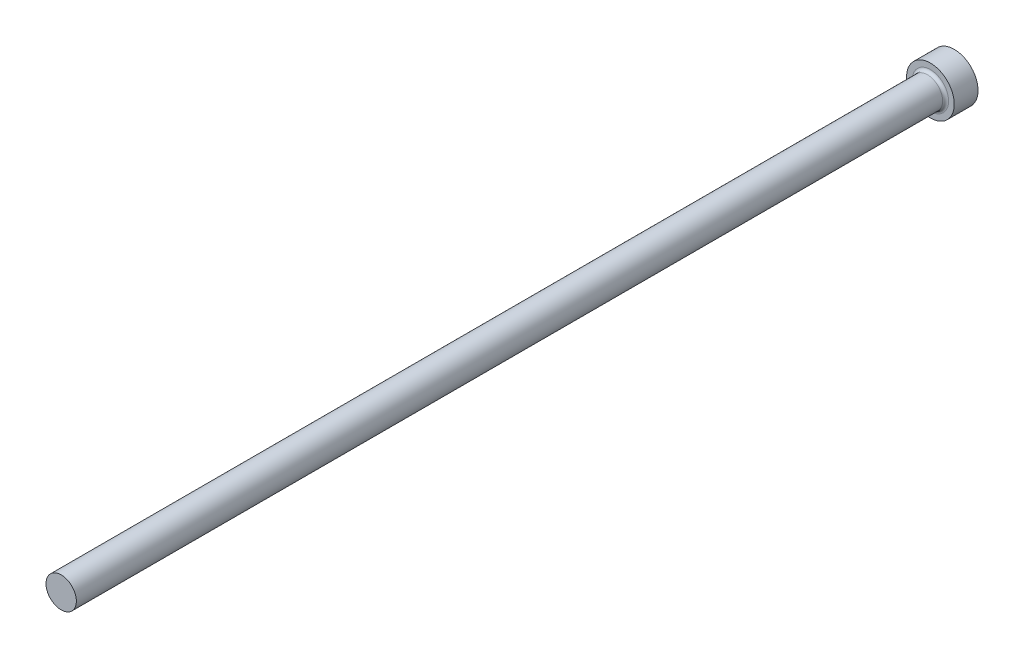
from build123d import *

# Parameters (mm, degrees)
FILLET1_R = 0.5


with BuildPart() as part:
    # FV → Revolve1 (revolve)
    with BuildSketch(Plane(origin=(0, 0, 0), x_dir=(1, 0, 0), z_dir=(0, 1, 0)), mode=Mode.PRIVATE) as revolve1_sk:
        Polygon((0, 0), (4, 0), (4, -4), (2.55, -4), (2.55, -150), (0, -150), align=None)
    revolve(revolve1_sk.sketch.rotate(Axis((0, 0, -9.033228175), (0, 0, 1)), 180), axis=Axis((0, 0, -9.033228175), (0, 0, 1)))

    # Fillet1
    fillet1_edges = [part.edges().sort_by_distance(p)[0] for p in [
        (2.55, 0, 4),
    ]]
    fillet(fillet1_edges, radius=FILLET1_R)


solid = part.part
